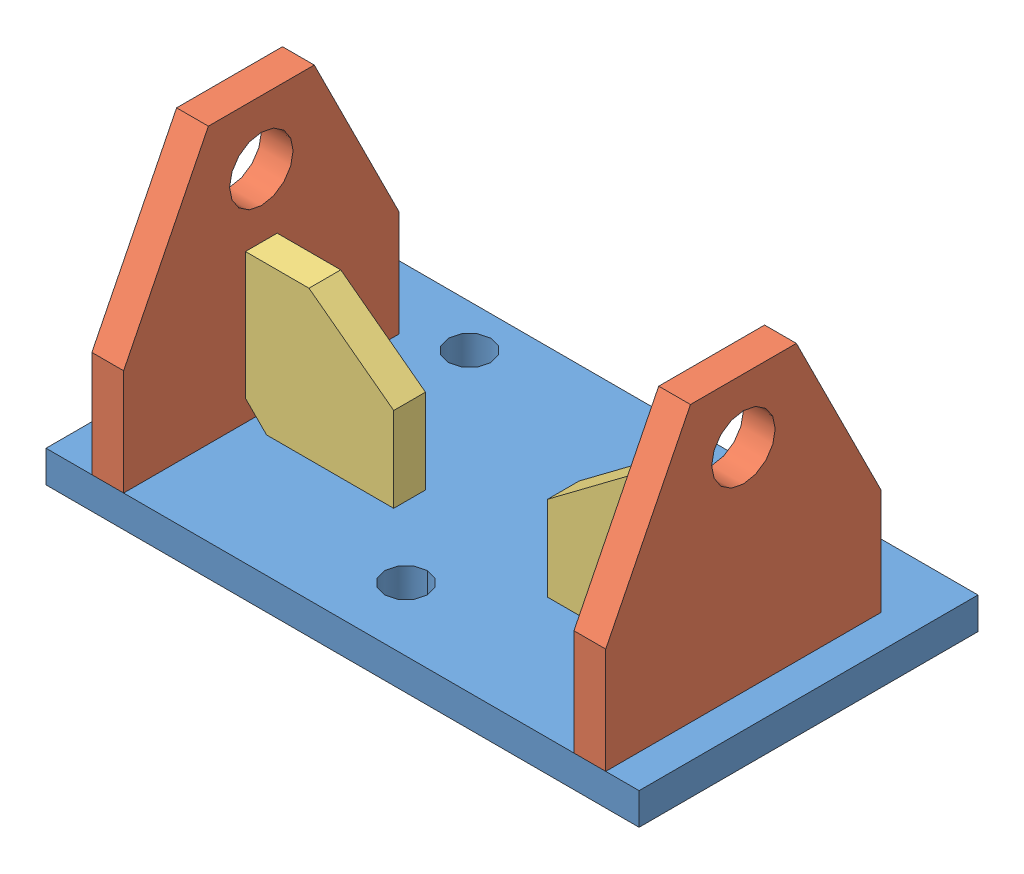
SolidWorks assembly Mates_&.SLDASM, configuration Default (file format 15000). Lengths in mm.
Overall size (177.8 92.08 101.6).
5 component instances, 3 part files, 12 mates.
Components (placement in the parent):
- RectBase_&-1: RectBase_&.SLDPRT [Default] at origin size (177.8 9.53 101.6)
- EndConnect_&-1: EndConnect_&.SLDPRT [Default] at (69.375 9.525 9.525) x (0 0 -1) z (1 0 0) size (82.55 82.55 9.53)
- EndConnect_&-2: EndConnect_&.SLDPRT [Default] at (-65.625 9.525 9.525) x (0 0 1) z (-1 0 0) size (82.55 82.55 9.53)
- Brace_&-1: Brace_&.SLDPRT [Default] at (69.375 9.525 9.525) x (-1 0 0) z (0 -1 0) size (44.45 9.53 44.45)
- Brace_&-2: Brace_&.SLDPRT [Default] at (-65.625 9.525 9.525) x (1 0 0) z (0 -1 0) size (44.45 9.53 44.45)
Mates (geometry in assembly coordinates):
- Distance1: distance = 10 mm aligned: plane of EndConnect_&-1 through (78.9 9.525 -31.75) normal (1 0 0); plane of RectBase_&-1 through (88.9 9.525 -50.8) normal (1 0 0)
- Coincident2: coincident anti-aligned: plane of RectBase_&-1 through (-88.9 9.525 50.8) normal (0 1 0); plane of EndConnect_&-1 through (78.9 9.525 -31.75) normal (0 -1 0)
- Coincident3: coincident aligned: plane of RectBase_&-1 through (-88.9 9.525 50.8) normal (0 0 1); plane of EndConnect_&-1 through (78.9 41.275 50.8) normal (0 0 1)
- Coincident4: coincident aligned: plane of RectBase_&-1 through (-88.9 9.525 50.8) normal (0 0 1); plane of EndConnect_&-2 through (-75.15 41.275 50.8) normal (0 0 1)
- Distance2: distance = 135 mm anti-aligned: plane of EndConnect_&-2 through (-65.625 9.525 50.8) normal (1 0 0); plane of EndConnect_&-1 through (69.375 9.525 -31.75) normal (-1 0 0)
- Coincident6: coincident anti-aligned: plane of RectBase_&-1 through (-88.9 9.525 50.8) normal (0 1 0); plane of EndConnect_&-2 through (-75.15 9.525 50.8) normal (0 -1 0)
- Coincident7: coincident anti-aligned: plane of RectBase_&-1 through (-88.9 9.525 50.8) normal (0 1 0); plane of Brace_&-2 through (-65.625 9.525 14.2875) normal (0 -1 0)
- Coincident8: coincident anti-aligned: plane of EndConnect_&-2 through (-65.625 9.525 50.8) normal (1 0 0); plane of Brace_&-2 through (-65.625 9.525 14.2875) normal (-1 0 0)
- Coincident9: coincident anti-aligned: plane of RectBase_&-1 through (-88.9 9.525 50.8) normal (0 1 0); plane of Brace_&-1 through (69.375 9.525 4.7625) normal (0 -1 0)
- Coincident10: coincident anti-aligned: plane of EndConnect_&-1 through (69.375 9.525 -31.75) normal (-1 0 0); plane of Brace_&-1 through (69.375 9.525 4.7625) normal (1 0 0)
- Coincident11: coincident aligned: plane of Brace_&-1 through (69.375 9.525 14.2875) normal (0 0 1); plane of Brace_&-2 through (-65.625 9.525 14.2875) normal (0 0 1)
- Width1: width anti-aligned: plane of EndConnect_&-2 through (-75.15 41.275 50.8) normal (0 0 1); plane of EndConnect_&-2 through (-75.15 41.275 -31.75) normal (0 0 -1); plane of Brace_&-2 through (-65.625 9.525 4.7625) normal (0 0 -1); plane of Brace_&-2 through (-65.625 9.525 14.2875) normal (0 0 1)
